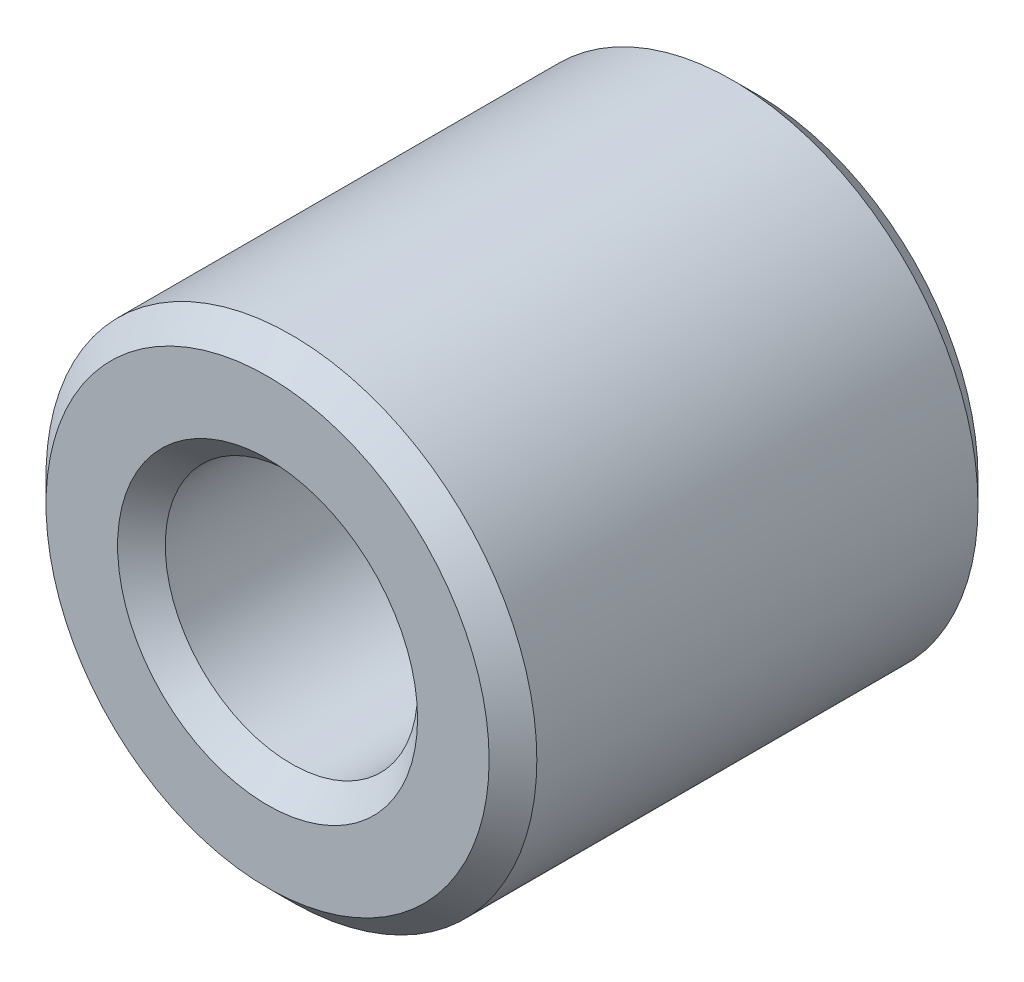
ISO-10303-21;
HEADER;
FILE_DESCRIPTION(('STEP AP214'),'2;1');
FILE_NAME('part.step','',(''),(''),'','','');
FILE_SCHEMA(('AUTOMOTIVE_DESIGN { 1 0 10303 214 1 1 1 1 }'));
ENDSEC;
DATA;
#1=APPLICATION_CONTEXT('core data for automotive mechanical design processes');
#2=APPLICATION_PROTOCOL_DEFINITION('international standard','automotive_design',2000,#1);
#3=PRODUCT_CONTEXT('',#1,'mechanical');
#4=PRODUCT('Part','Part','',(#3));
#5=PRODUCT_RELATED_PRODUCT_CATEGORY('part','',(#4));
#6=PRODUCT_DEFINITION_FORMATION('','',#4);
#7=PRODUCT_DEFINITION_CONTEXT('part definition',#1,'design');
#8=PRODUCT_DEFINITION('design','',#6,#7);
#9=PRODUCT_DEFINITION_SHAPE('','',#8);
#10=(LENGTH_UNIT() NAMED_UNIT(*) SI_UNIT(.MILLI.,.METRE.));
#11=(NAMED_UNIT(*) PLANE_ANGLE_UNIT() SI_UNIT($,.RADIAN.));
#12=(NAMED_UNIT(*) SI_UNIT($,.STERADIAN.) SOLID_ANGLE_UNIT());
#13=UNCERTAINTY_MEASURE_WITH_UNIT(LENGTH_MEASURE(1.E-05),#10,'distance_accuracy_value','');
#14=(GEOMETRIC_REPRESENTATION_CONTEXT(3) GLOBAL_UNCERTAINTY_ASSIGNED_CONTEXT((#13)) GLOBAL_UNIT_ASSIGNED_CONTEXT((#10,
#11,#12)) REPRESENTATION_CONTEXT('',''));
#15=CARTESIAN_POINT('',(0.,0.,0.));
#16=DIRECTION('',(0.,0.,1.));
#17=DIRECTION('',(1.,0.,0.));
#18=AXIS2_PLACEMENT_3D('',#15,#16,#17);
#19=CARTESIAN_POINT('',(0.,0.,3.175));
#20=DIRECTION('',(0.,0.,1.));
#21=DIRECTION('',(1.,0.,0.));
#22=AXIS2_PLACEMENT_3D('',#19,#20,#21);
#23=PLANE('',#22);
#24=CARTESIAN_POINT('',(0.,0.,3.175));
#25=DIRECTION('',(0.,0.,1.));
#26=DIRECTION('',(1.,0.,0.));
#27=AXIS2_PLACEMENT_3D('',#24,#25,#26);
#28=CIRCLE('',#27,1.94818);
#29=CARTESIAN_POINT('',(1.94818,0.,3.175));
#30=VERTEX_POINT('',#29);
#31=EDGE_CURVE('E10',#30,#30,#28,.F.);
#32=ORIENTED_EDGE('',*,*,#31,.T.);
#33=EDGE_LOOP('',(#32));
#34=FACE_BOUND('',#33,.T.);
#35=CARTESIAN_POINT('',(0.,0.,3.175));
#36=DIRECTION('',(0.,0.,1.));
#37=DIRECTION('',(1.,0.,0.));
#38=AXIS2_PLACEMENT_3D('',#35,#36,#37);
#39=CIRCLE('',#38,2.87782);
#40=CARTESIAN_POINT('',(2.87782,0.,3.175));
#41=VERTEX_POINT('',#40);
#42=EDGE_CURVE('E47',#41,#41,#39,.T.);
#43=ORIENTED_EDGE('',*,*,#42,.T.);
#44=EDGE_LOOP('',(#43));
#45=FACE_BOUND('',#44,.T.);
#46=ADVANCED_FACE('F39',(#34,#45),#23,.T.);
#47=CARTESIAN_POINT('',(0.,0.,-3.175));
#48=DIRECTION('',(0.,0.,1.));
#49=DIRECTION('',(1.,0.,0.));
#50=AXIS2_PLACEMENT_3D('',#47,#48,#49);
#51=PLANE('',#50);
#52=CARTESIAN_POINT('',(0.,0.,-3.175));
#53=DIRECTION('',(0.,0.,1.));
#54=DIRECTION('',(1.,0.,0.));
#55=AXIS2_PLACEMENT_3D('',#52,#53,#54);
#56=CIRCLE('',#55,1.94818);
#57=CARTESIAN_POINT('',(1.94818,0.,-3.175));
#58=VERTEX_POINT('',#57);
#59=EDGE_CURVE('E73',#58,#58,#56,.T.);
#60=ORIENTED_EDGE('',*,*,#59,.T.);
#61=EDGE_LOOP('',(#60));
#62=FACE_BOUND('',#61,.T.);
#63=CARTESIAN_POINT('',(0.,0.,-3.175));
#64=DIRECTION('',(0.,0.,1.));
#65=DIRECTION('',(1.,0.,0.));
#66=AXIS2_PLACEMENT_3D('',#63,#64,#65);
#67=CIRCLE('',#66,2.87782);
#68=CARTESIAN_POINT('',(2.87782,0.,-3.175));
#69=VERTEX_POINT('',#68);
#70=EDGE_CURVE('E77',#69,#69,#67,.F.);
#71=ORIENTED_EDGE('',*,*,#70,.T.);
#72=EDGE_LOOP('',(#71));
#73=FACE_BOUND('',#72,.T.);
#74=ADVANCED_FACE('F83',(#62,#73),#51,.F.);
#75=CARTESIAN_POINT('',(0.,0.,3.175));
#76=DIRECTION('',(0.,0.,-1.));
#77=DIRECTION('',(-1.,0.,0.));
#78=AXIS2_PLACEMENT_3D('',#75,#76,#77);
#79=CYLINDRICAL_SURFACE('',#78,3.1877);
#80=CARTESIAN_POINT('',(0.,0.,-2.86512));
#81=DIRECTION('',(0.,0.,1.));
#82=DIRECTION('',(1.,0.,0.));
#83=AXIS2_PLACEMENT_3D('',#80,#81,#82);
#84=CIRCLE('',#83,3.1877);
#85=CARTESIAN_POINT('',(3.1877,0.,-2.86512));
#86=VERTEX_POINT('',#85);
#87=EDGE_CURVE('E53',#86,#86,#84,.T.);
#88=ORIENTED_EDGE('',*,*,#87,.T.);
#89=EDGE_LOOP('',(#88));
#90=FACE_BOUND('',#89,.T.);
#91=CARTESIAN_POINT('',(0.,0.,2.86512));
#92=DIRECTION('',(0.,0.,1.));
#93=DIRECTION('',(1.,0.,0.));
#94=AXIS2_PLACEMENT_3D('',#91,#92,#93);
#95=CIRCLE('',#94,3.1877);
#96=CARTESIAN_POINT('',(3.1877,0.,2.86512));
#97=VERTEX_POINT('',#96);
#98=EDGE_CURVE('E59',#97,#97,#95,.F.);
#99=ORIENTED_EDGE('',*,*,#98,.T.);
#100=EDGE_LOOP('',(#99));
#101=FACE_BOUND('',#100,.T.);
#102=ADVANCED_FACE('F93',(#90,#101),#79,.T.);
#103=CARTESIAN_POINT('',(0.,0.,3.175));
#104=DIRECTION('',(0.,0.,-1.));
#105=DIRECTION('',(-1.,0.,0.));
#106=AXIS2_PLACEMENT_3D('',#103,#104,#105);
#107=CYLINDRICAL_SURFACE('',#106,1.6383);
#108=CARTESIAN_POINT('',(0.,0.,-2.86512));
#109=DIRECTION('',(0.,0.,1.));
#110=DIRECTION('',(1.,0.,0.));
#111=AXIS2_PLACEMENT_3D('',#108,#109,#110);
#112=CIRCLE('',#111,1.6383);
#113=CARTESIAN_POINT('',(1.6383,0.,-2.86512));
#114=VERTEX_POINT('',#113);
#115=EDGE_CURVE('E65',#114,#114,#112,.F.);
#116=ORIENTED_EDGE('',*,*,#115,.T.);
#117=EDGE_LOOP('',(#116));
#118=FACE_BOUND('',#117,.T.);
#119=CARTESIAN_POINT('',(0.,0.,2.86512));
#120=DIRECTION('',(0.,0.,1.));
#121=DIRECTION('',(1.,0.,0.));
#122=AXIS2_PLACEMENT_3D('',#119,#120,#121);
#123=CIRCLE('',#122,1.6383);
#124=CARTESIAN_POINT('',(1.6383,0.,2.86512));
#125=VERTEX_POINT('',#124);
#126=EDGE_CURVE('E69',#125,#125,#123,.T.);
#127=ORIENTED_EDGE('',*,*,#126,.T.);
#128=EDGE_LOOP('',(#127));
#129=FACE_BOUND('',#128,.T.);
#130=ADVANCED_FACE('F96',(#118,#129),#107,.F.);
#131=CARTESIAN_POINT('',(0.,0.,-3.175));
#132=DIRECTION('',(0.,0.,-1.));
#133=DIRECTION('',(-1.,0.,0.));
#134=AXIS2_PLACEMENT_3D('',#131,#132,#133);
#135=CONICAL_SURFACE('',#134,1.94818,0.785398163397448);
#136=ORIENTED_EDGE('',*,*,#115,.F.);
#137=EDGE_LOOP('',(#136));
#138=FACE_BOUND('',#137,.T.);
#139=ORIENTED_EDGE('',*,*,#59,.F.);
#140=EDGE_LOOP('',(#139));
#141=FACE_BOUND('',#140,.T.);
#142=ADVANCED_FACE('F89',(#138,#141),#135,.F.);
#143=CARTESIAN_POINT('',(0.,0.,-2.86512));
#144=DIRECTION('',(0.,0.,1.));
#145=DIRECTION('',(1.,0.,0.));
#146=AXIS2_PLACEMENT_3D('',#143,#144,#145);
#147=CONICAL_SURFACE('',#146,3.1877,0.78539816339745);
#148=ORIENTED_EDGE('',*,*,#70,.F.);
#149=EDGE_LOOP('',(#148));
#150=FACE_BOUND('',#149,.T.);
#151=ORIENTED_EDGE('',*,*,#87,.F.);
#152=EDGE_LOOP('',(#151));
#153=FACE_BOUND('',#152,.T.);
#154=ADVANCED_FACE('F85',(#150,#153),#147,.T.);
#155=CARTESIAN_POINT('',(0.,0.,2.86512));
#156=DIRECTION('',(0.,0.,1.));
#157=DIRECTION('',(1.,0.,0.));
#158=AXIS2_PLACEMENT_3D('',#155,#156,#157);
#159=CONICAL_SURFACE('',#158,1.6383,0.785398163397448);
#160=ORIENTED_EDGE('',*,*,#31,.F.);
#161=EDGE_LOOP('',(#160));
#162=FACE_BOUND('',#161,.T.);
#163=ORIENTED_EDGE('',*,*,#126,.F.);
#164=EDGE_LOOP('',(#163));
#165=FACE_BOUND('',#164,.T.);
#166=ADVANCED_FACE('F88',(#162,#165),#159,.F.);
#167=CARTESIAN_POINT('',(0.,0.,3.175));
#168=DIRECTION('',(0.,0.,-1.));
#169=DIRECTION('',(-1.,0.,0.));
#170=AXIS2_PLACEMENT_3D('',#167,#168,#169);
#171=CONICAL_SURFACE('',#170,2.87782,0.785398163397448);
#172=ORIENTED_EDGE('',*,*,#98,.F.);
#173=EDGE_LOOP('',(#172));
#174=FACE_BOUND('',#173,.T.);
#175=ORIENTED_EDGE('',*,*,#42,.F.);
#176=EDGE_LOOP('',(#175));
#177=FACE_BOUND('',#176,.T.);
#178=ADVANCED_FACE('F41',(#174,#177),#171,.T.);
#179=CLOSED_SHELL('',(#46,#74,#102,#130,#142,#154,#166,#178));
#180=MANIFOLD_SOLID_BREP('B2',#179);
#181=ADVANCED_BREP_SHAPE_REPRESENTATION('',(#18,#180),#14);
#182=SHAPE_DEFINITION_REPRESENTATION(#9,#181);
ENDSEC;
END-ISO-10303-21;
